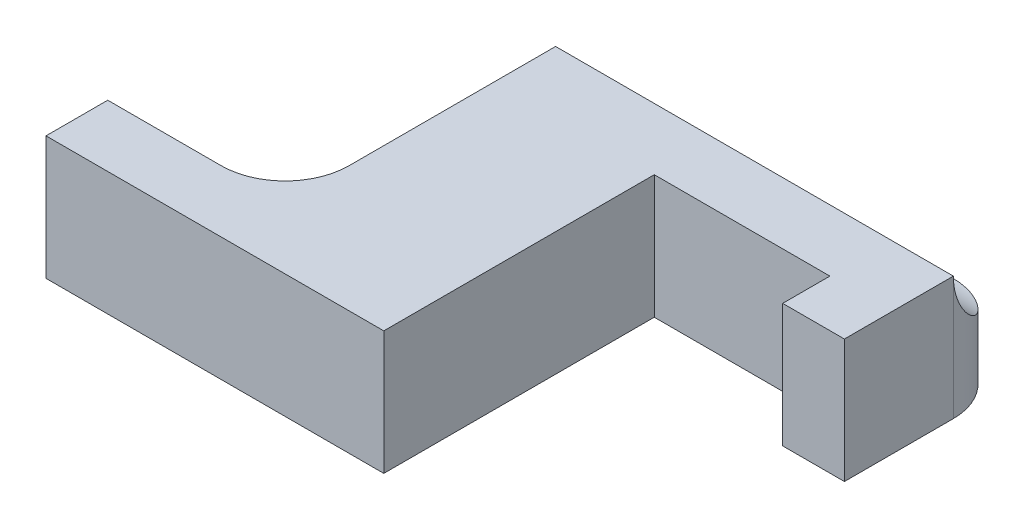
ISO-10303-21;
HEADER;
FILE_DESCRIPTION(('STEP AP214'),'2;1');
FILE_NAME('part.step','',(''),(''),'','','');
FILE_SCHEMA(('AUTOMOTIVE_DESIGN { 1 0 10303 214 1 1 1 1 }'));
ENDSEC;
DATA;
#1=APPLICATION_CONTEXT('core data for automotive mechanical design processes');
#2=APPLICATION_PROTOCOL_DEFINITION('international standard','automotive_design',2000,#1);
#3=PRODUCT_CONTEXT('',#1,'mechanical');
#4=PRODUCT('Part','Part','',(#3));
#5=PRODUCT_RELATED_PRODUCT_CATEGORY('part','',(#4));
#6=PRODUCT_DEFINITION_FORMATION('','',#4);
#7=PRODUCT_DEFINITION_CONTEXT('part definition',#1,'design');
#8=PRODUCT_DEFINITION('design','',#6,#7);
#9=PRODUCT_DEFINITION_SHAPE('','',#8);
#10=(LENGTH_UNIT() NAMED_UNIT(*) SI_UNIT(.MILLI.,.METRE.));
#11=(NAMED_UNIT(*) PLANE_ANGLE_UNIT() SI_UNIT($,.RADIAN.));
#12=(NAMED_UNIT(*) SI_UNIT($,.STERADIAN.) SOLID_ANGLE_UNIT());
#13=UNCERTAINTY_MEASURE_WITH_UNIT(LENGTH_MEASURE(1.E-05),#10,'distance_accuracy_value','');
#14=(GEOMETRIC_REPRESENTATION_CONTEXT(3) GLOBAL_UNCERTAINTY_ASSIGNED_CONTEXT((#13)) GLOBAL_UNIT_ASSIGNED_CONTEXT((#10,
#11,#12)) REPRESENTATION_CONTEXT('',''));
#15=CARTESIAN_POINT('',(0.,0.,0.));
#16=DIRECTION('',(0.,0.,1.));
#17=DIRECTION('',(1.,0.,0.));
#18=AXIS2_PLACEMENT_3D('',#15,#16,#17);
#19=CARTESIAN_POINT('',(-43.7469614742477,-10.16,-15.2607322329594));
#20=DIRECTION('',(0.,-1.,0.));
#21=DIRECTION('',(0.,0.,-1.));
#22=AXIS2_PLACEMENT_3D('',#19,#20,#21);
#23=PLANE('',#22);
#24=DIRECTION('',(0.,0.,-1.));
#25=VECTOR('',#24,1.);
#26=CARTESIAN_POINT('',(22.4271600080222,-10.16,-4.92293223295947));
#27=LINE('',#26,#25);
#28=CARTESIAN_POINT('',(22.4271600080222,-10.16,-4.92293223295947));
#29=VERTEX_POINT('',#28);
#30=CARTESIAN_POINT('',(22.4271600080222,-10.16,-10.0029322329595));
#31=VERTEX_POINT('',#30);
#32=EDGE_CURVE('E42',#29,#31,#27,.T.);
#33=ORIENTED_EDGE('',*,*,#32,.T.);
#34=DIRECTION('',(1.,0.,0.));
#35=VECTOR('',#34,1.);
#36=CARTESIAN_POINT('',(22.4271600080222,-10.16,-10.0029322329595));
#37=LINE('',#36,#35);
#38=CARTESIAN_POINT('',(31.7672385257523,-10.16,-10.0029322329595));
#39=VERTEX_POINT('',#38);
#40=EDGE_CURVE('E161',#31,#39,#37,.T.);
#41=ORIENTED_EDGE('',*,*,#40,.T.);
#42=CARTESIAN_POINT('',(31.7672385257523,-10.16,-15.2607322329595));
#43=DIRECTION('',(0.,1.,0.));
#44=DIRECTION('',(1.,0.,0.));
#45=AXIS2_PLACEMENT_3D('',#42,#43,#44);
#46=CIRCLE('',#45,5.2578);
#47=CARTESIAN_POINT('',(37.0250385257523,-10.16,-15.2607322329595));
#48=VERTEX_POINT('',#47);
#49=EDGE_CURVE('E137',#39,#48,#46,.T.);
#50=ORIENTED_EDGE('',*,*,#49,.T.);
#51=DIRECTION('',(0.,0.,-1.));
#52=VECTOR('',#51,1.);
#53=CARTESIAN_POINT('',(37.0250385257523,-10.16,-15.2607322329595));
#54=LINE('',#53,#52);
#55=CARTESIAN_POINT('',(37.0250385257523,-10.16,-32.2620041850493));
#56=VERTEX_POINT('',#55);
#57=EDGE_CURVE('E134',#48,#56,#54,.T.);
#58=ORIENTED_EDGE('',*,*,#57,.T.);
#59=CARTESIAN_POINT('',(41.9272385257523,-10.16,-32.2620041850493));
#60=DIRECTION('',(0.,1.,0.));
#61=DIRECTION('',(1.,0.,0.));
#62=AXIS2_PLACEMENT_3D('',#59,#60,#61);
#63=CIRCLE('',#62,4.90220000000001);
#64=CARTESIAN_POINT('',(41.9272385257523,-10.16,-37.1642041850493));
#65=VERTEX_POINT('',#64);
#66=EDGE_CURVE('E200',#56,#65,#63,.F.);
#67=ORIENTED_EDGE('',*,*,#66,.T.);
#68=DIRECTION('',(1.,0.,0.));
#69=VECTOR('',#68,1.);
#70=CARTESIAN_POINT('',(41.9272385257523,-10.16,-37.1642041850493));
#71=LINE('',#70,#69);
#72=CARTESIAN_POINT('',(64.8557385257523,-10.16,-37.1642041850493));
#73=VERTEX_POINT('',#72);
#74=EDGE_CURVE('E196',#65,#73,#71,.T.);
#75=ORIENTED_EDGE('',*,*,#74,.T.);
#76=CARTESIAN_POINT('',(64.8557385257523,-10.16,-32.2620041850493));
#77=DIRECTION('',(0.,1.,0.));
#78=DIRECTION('',(1.,0.,0.));
#79=AXIS2_PLACEMENT_3D('',#76,#77,#78);
#80=CIRCLE('',#79,4.90220000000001);
#81=CARTESIAN_POINT('',(69.7579385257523,-10.16,-32.2620041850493));
#82=VERTEX_POINT('',#81);
#83=EDGE_CURVE('E192',#73,#82,#80,.F.);
#84=ORIENTED_EDGE('',*,*,#83,.T.);
#85=DIRECTION('',(0.,0.,1.));
#86=VECTOR('',#85,1.);
#87=CARTESIAN_POINT('',(69.7579385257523,-10.16,-32.2620041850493));
#88=LINE('',#87,#86);
#89=CARTESIAN_POINT('',(69.7579385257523,-10.16,-23.2958041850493));
#90=VERTEX_POINT('',#89);
#91=EDGE_CURVE('E188',#82,#90,#88,.T.);
#92=ORIENTED_EDGE('',*,*,#91,.T.);
#93=DIRECTION('',(-1.,0.,0.));
#94=VECTOR('',#93,1.);
#95=CARTESIAN_POINT('',(69.7579385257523,-10.16,-23.2958041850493));
#96=LINE('',#95,#94);
#97=CARTESIAN_POINT('',(64.6779385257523,-10.16,-23.2958041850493));
#98=VERTEX_POINT('',#97);
#99=EDGE_CURVE('E184',#90,#98,#96,.T.);
#100=ORIENTED_EDGE('',*,*,#99,.T.);
#101=DIRECTION('',(0.,0.,-1.));
#102=VECTOR('',#101,1.);
#103=CARTESIAN_POINT('',(64.6779385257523,-10.16,-23.2958041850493));
#104=LINE('',#103,#102);
#105=CARTESIAN_POINT('',(64.6779385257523,-10.16,-27.1820041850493));
#106=VERTEX_POINT('',#105);
#107=EDGE_CURVE('E180',#98,#106,#104,.T.);
#108=ORIENTED_EDGE('',*,*,#107,.T.);
#109=DIRECTION('',(-1.,0.,0.));
#110=VECTOR('',#109,1.);
#111=CARTESIAN_POINT('',(64.6779385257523,-10.16,-27.1820041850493));
#112=LINE('',#111,#110);
#113=CARTESIAN_POINT('',(50.2253385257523,-10.16,-27.1820041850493));
#114=VERTEX_POINT('',#113);
#115=EDGE_CURVE('E176',#106,#114,#112,.T.);
#116=ORIENTED_EDGE('',*,*,#115,.T.);
#117=DIRECTION('',(0.,0.,1.));
#118=VECTOR('',#117,1.);
#119=CARTESIAN_POINT('',(50.2253385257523,-10.16,-27.1820041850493));
#120=LINE('',#119,#118);
#121=CARTESIAN_POINT('',(50.2253385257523,-10.16,-4.92293223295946));
#122=VERTEX_POINT('',#121);
#123=EDGE_CURVE('E172',#114,#122,#120,.T.);
#124=ORIENTED_EDGE('',*,*,#123,.T.);
#125=DIRECTION('',(-1.,0.,0.));
#126=VECTOR('',#125,1.);
#127=CARTESIAN_POINT('',(50.2253385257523,-10.16,-4.92293223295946));
#128=LINE('',#127,#126);
#129=EDGE_CURVE('E168',#122,#29,#128,.T.);
#130=ORIENTED_EDGE('',*,*,#129,.T.);
#131=EDGE_LOOP('',(#33,#41,#50,#58,#67,#75,#84,#92,#100,#108,#116,#124,#130));
#132=FACE_BOUND('',#131,.T.);
#133=ADVANCED_FACE('F35',(#132),#23,.T.);
#134=CARTESIAN_POINT('',(31.7672385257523,0.,-15.2607322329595));
#135=DIRECTION('',(0.,-1.,0.));
#136=DIRECTION('',(0.,0.,1.));
#137=AXIS2_PLACEMENT_3D('',#134,#135,#136);
#138=PLANE('',#137);
#139=DIRECTION('',(0.,0.,-1.));
#140=VECTOR('',#139,1.);
#141=CARTESIAN_POINT('',(37.0250385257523,0.,-15.2607322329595));
#142=LINE('',#141,#140);
#143=CARTESIAN_POINT('',(37.0250385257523,0.,-15.2607322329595));
#144=VERTEX_POINT('',#143);
#145=CARTESIAN_POINT('',(37.0250385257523,0.,-32.2620041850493));
#146=VERTEX_POINT('',#145);
#147=EDGE_CURVE('E132',#144,#146,#142,.T.);
#148=ORIENTED_EDGE('',*,*,#147,.F.);
#149=CARTESIAN_POINT('',(31.7672385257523,0.,-15.2607322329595));
#150=DIRECTION('',(0.,1.,0.));
#151=DIRECTION('',(0.,0.,1.));
#152=AXIS2_PLACEMENT_3D('',#149,#150,#151);
#153=CIRCLE('',#152,5.2578);
#154=CARTESIAN_POINT('',(31.7672385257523,0.,-10.0029322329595));
#155=VERTEX_POINT('',#154);
#156=EDGE_CURVE('E140',#155,#144,#153,.T.);
#157=ORIENTED_EDGE('',*,*,#156,.F.);
#158=DIRECTION('',(1.,0.,0.));
#159=VECTOR('',#158,1.);
#160=CARTESIAN_POINT('',(22.4271600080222,0.,-10.0029322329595));
#161=LINE('',#160,#159);
#162=CARTESIAN_POINT('',(22.4271600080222,0.,-10.0029322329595));
#163=VERTEX_POINT('',#162);
#164=EDGE_CURVE('E144',#163,#155,#161,.T.);
#165=ORIENTED_EDGE('',*,*,#164,.F.);
#166=DIRECTION('',(0.,0.,-1.));
#167=VECTOR('',#166,1.);
#168=CARTESIAN_POINT('',(22.4271600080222,0.,-4.92293223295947));
#169=LINE('',#168,#167);
#170=CARTESIAN_POINT('',(22.4271600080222,0.,-4.92293223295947));
#171=VERTEX_POINT('',#170);
#172=EDGE_CURVE('E158',#171,#163,#169,.T.);
#173=ORIENTED_EDGE('',*,*,#172,.F.);
#174=DIRECTION('',(-1.,0.,0.));
#175=VECTOR('',#174,1.);
#176=CARTESIAN_POINT('',(50.2253385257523,0.,-4.92293223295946));
#177=LINE('',#176,#175);
#178=CARTESIAN_POINT('',(50.2253385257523,0.,-4.92293223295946));
#179=VERTEX_POINT('',#178);
#180=EDGE_CURVE('E164',#179,#171,#177,.T.);
#181=ORIENTED_EDGE('',*,*,#180,.F.);
#182=DIRECTION('',(0.,0.,1.));
#183=VECTOR('',#182,1.);
#184=CARTESIAN_POINT('',(50.2253385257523,0.,-27.1820041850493));
#185=LINE('',#184,#183);
#186=CARTESIAN_POINT('',(50.2253385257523,0.,-27.1820041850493));
#187=VERTEX_POINT('',#186);
#188=EDGE_CURVE('E249',#187,#179,#185,.T.);
#189=ORIENTED_EDGE('',*,*,#188,.F.);
#190=DIRECTION('',(-1.,0.,0.));
#191=VECTOR('',#190,1.);
#192=CARTESIAN_POINT('',(64.6779385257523,0.,-27.1820041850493));
#193=LINE('',#192,#191);
#194=CARTESIAN_POINT('',(64.6779385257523,0.,-27.1820041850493));
#195=VERTEX_POINT('',#194);
#196=EDGE_CURVE('E244',#195,#187,#193,.T.);
#197=ORIENTED_EDGE('',*,*,#196,.F.);
#198=DIRECTION('',(0.,0.,-1.));
#199=VECTOR('',#198,1.);
#200=CARTESIAN_POINT('',(64.6779385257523,0.,-23.2958041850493));
#201=LINE('',#200,#199);
#202=CARTESIAN_POINT('',(64.6779385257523,0.,-23.2958041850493));
#203=VERTEX_POINT('',#202);
#204=EDGE_CURVE('E242',#203,#195,#201,.T.);
#205=ORIENTED_EDGE('',*,*,#204,.F.);
#206=DIRECTION('',(-1.,0.,0.));
#207=VECTOR('',#206,1.);
#208=CARTESIAN_POINT('',(69.7579385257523,0.,-23.2958041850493));
#209=LINE('',#208,#207);
#210=CARTESIAN_POINT('',(69.7579385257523,0.,-23.2958041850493));
#211=VERTEX_POINT('',#210);
#212=EDGE_CURVE('E153',#211,#203,#209,.T.);
#213=ORIENTED_EDGE('',*,*,#212,.F.);
#214=DIRECTION('',(0.,0.,1.));
#215=VECTOR('',#214,1.);
#216=CARTESIAN_POINT('',(69.7579385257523,0.,-32.2620041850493));
#217=LINE('',#216,#215);
#218=CARTESIAN_POINT('',(69.7579385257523,0.,-32.2620041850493));
#219=VERTEX_POINT('',#218);
#220=EDGE_CURVE('E150',#219,#211,#217,.T.);
#221=ORIENTED_EDGE('',*,*,#220,.F.);
#222=DIRECTION('',(1.,0.,0.));
#223=VECTOR('',#222,1.);
#224=CARTESIAN_POINT('',(22.4271600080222,0.,-32.2620041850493));
#225=LINE('',#224,#223);
#226=EDGE_CURVE('E149',#146,#219,#225,.T.);
#227=ORIENTED_EDGE('',*,*,#226,.F.);
#228=EDGE_LOOP('',(#148,#157,#165,#173,#181,#189,#197,#205,#213,#221,#227));
#229=FACE_BOUND('',#228,.T.);
#230=ADVANCED_FACE('F147',(#229),#138,.F.);
#231=CARTESIAN_POINT('',(22.4271600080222,-67.428684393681,-10.0029322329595));
#232=DIRECTION('',(0.,0.,-1.));
#233=DIRECTION('',(1.,0.,0.));
#234=AXIS2_PLACEMENT_3D('',#231,#232,#233);
#235=PLANE('',#234);
#236=DIRECTION('',(0.,1.,0.));
#237=VECTOR('',#236,1.);
#238=CARTESIAN_POINT('',(22.4271600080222,-67.428684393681,-10.0029322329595));
#239=LINE('',#238,#237);
#240=EDGE_CURVE('E11',#31,#163,#239,.T.);
#241=ORIENTED_EDGE('',*,*,#240,.T.);
#242=ORIENTED_EDGE('',*,*,#164,.T.);
#243=DIRECTION('',(0.,1.,0.));
#244=VECTOR('',#243,1.);
#245=CARTESIAN_POINT('',(31.7672385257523,-67.428684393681,-10.0029322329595));
#246=LINE('',#245,#244);
#247=EDGE_CURVE('E106',#39,#155,#246,.T.);
#248=ORIENTED_EDGE('',*,*,#247,.F.);
#249=ORIENTED_EDGE('',*,*,#40,.F.);
#250=EDGE_LOOP('',(#241,#242,#248,#249));
#251=FACE_BOUND('',#250,.T.);
#252=ADVANCED_FACE('F274',(#251),#235,.T.);
#253=CARTESIAN_POINT('',(31.7672385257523,-67.428684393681,-15.2607322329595));
#254=DIRECTION('',(0.,1.,0.));
#255=DIRECTION('',(0.,0.,-1.));
#256=AXIS2_PLACEMENT_3D('',#253,#254,#255);
#257=CYLINDRICAL_SURFACE('',#256,5.2578);
#258=ORIENTED_EDGE('',*,*,#247,.T.);
#259=ORIENTED_EDGE('',*,*,#156,.T.);
#260=DIRECTION('',(0.,1.,0.));
#261=VECTOR('',#260,1.);
#262=CARTESIAN_POINT('',(37.0250385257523,-67.428684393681,-15.2607322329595));
#263=LINE('',#262,#261);
#264=EDGE_CURVE('E128',#48,#144,#263,.T.);
#265=ORIENTED_EDGE('',*,*,#264,.F.);
#266=ORIENTED_EDGE('',*,*,#49,.F.);
#267=EDGE_LOOP('',(#258,#259,#265,#266));
#268=FACE_BOUND('',#267,.T.);
#269=ADVANCED_FACE('F141',(#268),#257,.F.);
#270=CARTESIAN_POINT('',(37.0250385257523,-67.428684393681,-15.2607322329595));
#271=DIRECTION('',(-1.,0.,0.));
#272=DIRECTION('',(0.,0.,-1.));
#273=AXIS2_PLACEMENT_3D('',#270,#271,#272);
#274=PLANE('',#273);
#275=ORIENTED_EDGE('',*,*,#264,.T.);
#276=ORIENTED_EDGE('',*,*,#147,.T.);
#277=DIRECTION('',(0.,1.,0.));
#278=VECTOR('',#277,1.);
#279=CARTESIAN_POINT('',(37.0250385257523,-67.428684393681,-32.2620041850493));
#280=LINE('',#279,#278);
#281=EDGE_CURVE('E203',#56,#146,#280,.T.);
#282=ORIENTED_EDGE('',*,*,#281,.F.);
#283=ORIENTED_EDGE('',*,*,#57,.F.);
#284=EDGE_LOOP('',(#275,#276,#282,#283));
#285=FACE_BOUND('',#284,.T.);
#286=ADVANCED_FACE('F130',(#285),#274,.T.);
#287=CARTESIAN_POINT('',(41.9272385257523,-67.428684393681,-32.2620041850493));
#288=DIRECTION('',(0.,1.,0.));
#289=DIRECTION('',(0.,0.,-1.));
#290=AXIS2_PLACEMENT_3D('',#287,#288,#289);
#291=CYLINDRICAL_SURFACE('',#290,4.90220000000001);
#292=CARTESIAN_POINT('',(37.0250385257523,0.,-32.2620041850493));
#293=CARTESIAN_POINT('',(37.0250837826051,-0.141476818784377,-32.2619894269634));
#294=CARTESIAN_POINT('',(37.0250399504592,-0.282951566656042,-32.2679137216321));
#295=CARTESIAN_POINT('',(37.02510115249,-0.564914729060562,-32.2915342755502));
#296=CARTESIAN_POINT('',(37.0252061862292,-0.705403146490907,-32.3092305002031));
#297=CARTESIAN_POINT('',(37.0258928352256,-0.984686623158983,-32.3563350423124));
#298=CARTESIAN_POINT('',(37.0264753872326,-1.1234778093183,-32.3857663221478));
#299=CARTESIAN_POINT('',(37.0287563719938,-1.39810469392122,-32.456127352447));
#300=CARTESIAN_POINT('',(37.0304547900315,-1.5339404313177,-32.4970569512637));
#301=CARTESIAN_POINT('',(37.0358130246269,-1.80184382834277,-32.5901736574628));
#302=CARTESIAN_POINT('',(37.0394751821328,-1.93390679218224,-32.6423741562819));
#303=CARTESIAN_POINT('',(37.0498109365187,-2.19310130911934,-32.757593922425));
#304=CARTESIAN_POINT('',(37.0564843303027,-2.32023319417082,-32.8206124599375));
#305=CARTESIAN_POINT('',(37.0740501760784,-2.56847018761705,-32.9568713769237));
#306=CARTESIAN_POINT('',(37.0849392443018,-2.68958004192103,-33.0301035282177));
#307=CARTESIAN_POINT('',(37.1122736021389,-2.92484744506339,-33.1860949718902));
#308=CARTESIAN_POINT('',(37.1287184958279,-3.03900548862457,-33.2688535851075));
#309=CARTESIAN_POINT('',(37.1677098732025,-3.25460334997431,-33.4391831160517));
#310=CARTESIAN_POINT('',(37.1899644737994,-3.3563786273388,-33.5263954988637));
#311=CARTESIAN_POINT('',(37.2420582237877,-3.55171532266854,-33.7075230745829));
#312=CARTESIAN_POINT('',(37.2718971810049,-3.64527694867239,-33.8014380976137));
#313=CARTESIAN_POINT('',(37.3402145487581,-3.82324792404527,-33.9944111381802));
#314=CARTESIAN_POINT('',(37.3786811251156,-3.90766957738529,-34.0934619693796));
#315=CARTESIAN_POINT('',(37.4651623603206,-4.06684619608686,-34.2950958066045));
#316=CARTESIAN_POINT('',(37.5131752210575,-4.1416029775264,-34.3976781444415));
#317=CARTESIAN_POINT('',(37.6116568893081,-4.27100568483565,-34.5894947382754));
#318=CARTESIAN_POINT('',(37.6607727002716,-4.3269970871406,-34.6785202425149));
#319=CARTESIAN_POINT('',(37.7665594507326,-4.43158434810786,-34.8564249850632));
#320=CARTESIAN_POINT('',(37.8232299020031,-4.4801806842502,-34.9453042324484));
#321=CARTESIAN_POINT('',(37.9440732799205,-4.57012883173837,-35.1216165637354));
#322=CARTESIAN_POINT('',(38.0082465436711,-4.61148031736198,-35.2090495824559));
#323=CARTESIAN_POINT('',(38.1438538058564,-4.68728243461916,-35.3812305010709));
#324=CARTESIAN_POINT('',(38.2152878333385,-4.72173303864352,-35.4659783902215));
#325=CARTESIAN_POINT('',(38.3603354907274,-4.7822888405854,-35.6264845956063));
#326=CARTESIAN_POINT('',(38.433533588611,-4.80878115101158,-35.7024736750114));
#327=CARTESIAN_POINT('',(38.5855765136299,-4.85668218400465,-35.8503338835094));
#328=CARTESIAN_POINT('',(38.6644231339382,-4.87808928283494,-35.922203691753));
#329=CARTESIAN_POINT('',(38.8272708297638,-4.91639149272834,-36.0611109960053));
#330=CARTESIAN_POINT('',(38.9112709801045,-4.9332874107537,-36.1281493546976));
#331=CARTESIAN_POINT('',(39.0839557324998,-4.96318848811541,-36.2568668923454));
#332=CARTESIAN_POINT('',(39.1726420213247,-4.97619223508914,-36.3185441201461));
#333=CARTESIAN_POINT('',(39.4618779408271,-5.01240745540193,-36.5057422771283));
#334=CARTESIAN_POINT('',(39.6704519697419,-5.02945528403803,-36.6203108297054));
#335=CARTESIAN_POINT('',(40.1025231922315,-5.05390878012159,-36.8181578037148));
#336=CARTESIAN_POINT('',(40.3260294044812,-5.06130856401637,-36.9014171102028));
#337=CARTESIAN_POINT('',(40.6656494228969,-5.06860877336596,-37.0005117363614));
#338=CARTESIAN_POINT('',(40.7781605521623,-5.07040906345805,-37.0290426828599));
#339=CARTESIAN_POINT('',(41.004952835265,-5.07319881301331,-37.0780607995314));
#340=CARTESIAN_POINT('',(41.1192339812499,-5.07418827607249,-37.098548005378));
#341=CARTESIAN_POINT('',(41.3488439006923,-5.07565789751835,-37.1313429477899));
#342=CARTESIAN_POINT('',(41.4641715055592,-5.07613856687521,-37.1436588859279));
#343=CARTESIAN_POINT('',(41.6954112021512,-5.07674304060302,-37.1600928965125));
#344=CARTESIAN_POINT('',(41.8113232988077,-5.07686684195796,-37.1642108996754));
#345=CARTESIAN_POINT('',(41.9272385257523,-5.07688754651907,-37.1642041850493));
#346=B_SPLINE_CURVE_WITH_KNOTS('',3,(#292,#293,#294,#295,#296,#297,#298,#299,#300,#301,#302,
#303,#304,#305,#306,#307,#308,#309,#310,#311,#312,#313,#314,#315,#316,#317,#318,#319,#320,#321,
#322,#323,#324,#325,#326,#327,#328,#329,#330,#331,#332,#333,#334,#335,#336,#337,#338,#339,#340,
#341,#342,#343,#344,#345),.UNSPECIFIED.,.F.,.F.,(4,2,2,2,2,2,2,2,2,2,2,2,2,2,2,2,2,2,2,2,2,2,2,
2,2,2,4),(0.,0.424303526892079,0.848605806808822,1.27374244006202,1.69887346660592,
2.12451241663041,2.55012266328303,2.97539199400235,3.4006310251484,3.80763525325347,
4.21462916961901,4.62106820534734,5.02743075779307,5.37518369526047,5.72291416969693,
6.07066027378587,6.41840776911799,6.74441266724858,7.0705215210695,7.39657200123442,
7.72274065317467,8.43541304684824,9.14851983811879,9.49653487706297,9.84454837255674,
10.1922120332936,10.5398786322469),.UNSPECIFIED.);
#347=CARTESIAN_POINT('',(41.9272385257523,-5.07688754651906,-37.1642041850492));
#348=VERTEX_POINT('',#347);
#349=EDGE_CURVE('E160',#146,#348,#346,.T.);
#350=ORIENTED_EDGE('',*,*,#349,.T.);
#351=DIRECTION('',(0.,1.,0.));
#352=VECTOR('',#351,1.);
#353=CARTESIAN_POINT('',(41.9272385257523,-67.428684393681,-37.1642041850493));
#354=LINE('',#353,#352);
#355=EDGE_CURVE('E199',#65,#348,#354,.T.);
#356=ORIENTED_EDGE('',*,*,#355,.F.);
#357=ORIENTED_EDGE('',*,*,#66,.F.);
#358=ORIENTED_EDGE('',*,*,#281,.T.);
#359=EDGE_LOOP('',(#350,#356,#357,#358));
#360=FACE_BOUND('',#359,.T.);
#361=ADVANCED_FACE('F221',(#360),#291,.T.);
#362=CARTESIAN_POINT('',(41.9272385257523,-67.428684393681,-37.1642041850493));
#363=DIRECTION('',(0.,0.,-1.));
#364=DIRECTION('',(1.,0.,0.));
#365=AXIS2_PLACEMENT_3D('',#362,#363,#364);
#366=PLANE('',#365);
#367=DIRECTION('',(1.,0.,0.));
#368=VECTOR('',#367,1.);
#369=CARTESIAN_POINT('',(22.4271600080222,-5.07688754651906,-37.1642041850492));
#370=LINE('',#369,#368);
#371=CARTESIAN_POINT('',(64.8557385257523,-5.07688754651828,-37.1642041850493));
#372=VERTEX_POINT('',#371);
#373=EDGE_CURVE('E226',#348,#372,#370,.T.);
#374=ORIENTED_EDGE('',*,*,#373,.T.);
#375=DIRECTION('',(0.,1.,0.));
#376=VECTOR('',#375,1.);
#377=CARTESIAN_POINT('',(64.8557385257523,-67.428684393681,-37.1642041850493));
#378=LINE('',#377,#376);
#379=EDGE_CURVE('E195',#73,#372,#378,.T.);
#380=ORIENTED_EDGE('',*,*,#379,.F.);
#381=ORIENTED_EDGE('',*,*,#74,.F.);
#382=ORIENTED_EDGE('',*,*,#355,.T.);
#383=EDGE_LOOP('',(#374,#380,#381,#382));
#384=FACE_BOUND('',#383,.T.);
#385=ADVANCED_FACE('F270',(#384),#366,.T.);
#386=CARTESIAN_POINT('',(64.8557385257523,-67.428684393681,-32.2620041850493));
#387=DIRECTION('',(0.,1.,0.));
#388=DIRECTION('',(0.,0.,-1.));
#389=AXIS2_PLACEMENT_3D('',#386,#387,#388);
#390=CYLINDRICAL_SURFACE('',#389,4.90220000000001);
#391=CARTESIAN_POINT('',(64.8557385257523,-5.07688754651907,-37.1642041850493));
#392=CARTESIAN_POINT('',(64.991731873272,-5.07684785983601,-37.1642183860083));
#393=CARTESIAN_POINT('',(65.1277240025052,-5.0766880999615,-37.1585458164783));
#394=CARTESIAN_POINT('',(65.3987686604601,-5.07584180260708,-37.1359287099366));
#395=CARTESIAN_POINT('',(65.5338211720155,-5.07515525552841,-37.1189839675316));
#396=CARTESIAN_POINT('',(65.8022954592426,-5.07296668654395,-37.0738819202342));
#397=CARTESIAN_POINT('',(65.9357137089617,-5.07146314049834,-37.0457036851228));
#398=CARTESIAN_POINT('',(66.1997184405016,-5.06707959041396,-36.9783415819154));
#399=CARTESIAN_POINT('',(66.3303049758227,-5.06419961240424,-36.9391579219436));
#400=CARTESIAN_POINT('',(66.5878695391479,-5.05631800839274,-36.8500191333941));
#401=CARTESIAN_POINT('',(66.7148428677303,-5.05131374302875,-36.8000506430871));
#402=CARTESIAN_POINT('',(66.9640525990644,-5.03826126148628,-36.6897733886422));
#403=CARTESIAN_POINT('',(67.0862893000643,-5.03021323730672,-36.6294652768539));
#404=CARTESIAN_POINT('',(67.3249670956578,-5.01001508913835,-36.4990961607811));
#405=CARTESIAN_POINT('',(67.4414130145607,-4.99786844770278,-36.4290434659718));
#406=CARTESIAN_POINT('',(67.6676359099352,-4.96830199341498,-36.279858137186));
#407=CARTESIAN_POINT('',(67.7774133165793,-4.95088252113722,-36.200726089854));
#408=CARTESIAN_POINT('',(67.9850891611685,-4.91037836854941,-36.037644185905));
#409=CARTESIAN_POINT('',(68.0832869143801,-4.88754771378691,-35.9540129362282));
#410=CARTESIAN_POINT('',(68.2718019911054,-4.83484778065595,-35.7803131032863));
#411=CARTESIAN_POINT('',(68.3621195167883,-4.8049786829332,-35.6902446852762));
#412=CARTESIAN_POINT('',(68.534029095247,-4.73728725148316,-35.5051019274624));
#413=CARTESIAN_POINT('',(68.6156306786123,-4.69947374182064,-35.4100332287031));
#414=CARTESIAN_POINT('',(68.7696260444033,-4.61511346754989,-35.216381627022));
#415=CARTESIAN_POINT('',(68.8420212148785,-4.56856802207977,-35.1177992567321));
#416=CARTESIAN_POINT('',(68.9686919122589,-4.47274222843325,-34.9315021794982));
#417=CARTESIAN_POINT('',(69.0241010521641,-4.42455519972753,-34.8439927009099));
#418=CARTESIAN_POINT('',(69.1276028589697,-4.32101629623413,-34.6688862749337));
#419=CARTESIAN_POINT('',(69.1756958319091,-4.26566472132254,-34.5812893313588));
#420=CARTESIAN_POINT('',(69.2647135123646,-4.14784739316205,-34.4072459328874));
#421=CARTESIAN_POINT('',(69.3056379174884,-4.08538133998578,-34.3207995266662));
#422=CARTESIAN_POINT('',(69.3806518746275,-3.95355669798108,-34.1502324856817));
#423=CARTESIAN_POINT('',(69.4147413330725,-3.88419801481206,-34.0661118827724));
#424=CARTESIAN_POINT('',(69.4751843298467,-3.74222448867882,-33.904975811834));
#425=CARTESIAN_POINT('',(69.501817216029,-3.66989715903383,-33.8278109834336));
#426=CARTESIAN_POINT('',(69.5498428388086,-3.51965621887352,-33.6773449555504));
#427=CARTESIAN_POINT('',(69.5712338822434,-3.44174081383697,-33.6040450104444));
#428=CARTESIAN_POINT('',(69.609361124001,-3.28080160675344,-33.4620224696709));
#429=CARTESIAN_POINT('',(69.6260980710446,-3.19777862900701,-33.393299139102));
#430=CARTESIAN_POINT('',(69.6555591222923,-3.02705170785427,-33.2609466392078));
#431=CARTESIAN_POINT('',(69.6682817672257,-2.9393460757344,-33.197319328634));
#432=CARTESIAN_POINT('',(69.6915283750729,-2.75010174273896,-33.0690932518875));
#433=CARTESIAN_POINT('',(69.7016694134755,-2.64808906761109,-33.0051241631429));
#434=CARTESIAN_POINT('',(69.7186405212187,-2.43953035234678,-32.8844695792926));
#435=CARTESIAN_POINT('',(69.7254691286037,-2.33298233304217,-32.8277873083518));
#436=CARTESIAN_POINT('',(69.736591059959,-2.11595894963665,-32.722080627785));
#437=CARTESIAN_POINT('',(69.7408830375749,-2.00548153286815,-32.6730602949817));
#438=CARTESIAN_POINT('',(69.7476260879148,-1.78126322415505,-32.5830021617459));
#439=CARTESIAN_POINT('',(69.7500770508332,-1.66752213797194,-32.5419648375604));
#440=CARTESIAN_POINT('',(69.7539058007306,-1.42725005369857,-32.4648488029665));
#441=CARTESIAN_POINT('',(69.7551701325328,-1.30047452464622,-32.4295245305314));
#442=CARTESIAN_POINT('',(69.7568682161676,-1.0445527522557,-32.3688150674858));
#443=CARTESIAN_POINT('',(69.7573018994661,-0.915406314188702,-32.3434306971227));
#444=CARTESIAN_POINT('',(69.7578136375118,-0.65560734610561,-32.3027733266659));
#445=CARTESIAN_POINT('',(69.7578918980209,-0.524955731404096,-32.2874944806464));
#446=CARTESIAN_POINT('',(69.7579374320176,-0.262869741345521,-32.2671046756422));
#447=CARTESIAN_POINT('',(69.7579047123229,-0.131435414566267,-32.2619930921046));
#448=CARTESIAN_POINT('',(69.7579385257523,0.,-32.2620041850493));
#449=B_SPLINE_CURVE_WITH_KNOTS('',3,(#391,#392,#393,#394,#395,#396,#397,#398,#399,#400,#401,
#402,#403,#404,#405,#406,#407,#408,#409,#410,#411,#412,#413,#414,#415,#416,#417,#418,#419,#420,
#421,#422,#423,#424,#425,#426,#427,#428,#429,#430,#431,#432,#433,#434,#435,#436,#437,#438,#439,
#440,#441,#442,#443,#444,#445,#446,#447,#448),.UNSPECIFIED.,.F.,.F.,(4,2,2,2,2,2,2,2,2,2,2,2,2,
2,2,2,2,2,2,2,2,2,2,2,2,2,2,2,4),(0.,0.40786010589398,0.815727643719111,1.22435869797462,
1.63298202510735,2.04211454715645,2.45122126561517,2.85998124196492,3.26871482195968,
3.66112534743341,4.05352580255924,4.4454926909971,4.83740041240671,5.17966371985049,
5.52191270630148,5.8641761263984,6.20644423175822,6.53329100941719,6.86024322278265,
7.18714280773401,7.51416108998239,7.87630335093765,8.23860529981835,8.60109937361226,
8.963615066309,9.35804067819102,9.75249883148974,10.1467285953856,10.5409341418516),.UNSPECIFIED.);
#450=EDGE_CURVE('E49',#372,#219,#449,.T.);
#451=ORIENTED_EDGE('',*,*,#450,.T.);
#452=DIRECTION('',(0.,1.,0.));
#453=VECTOR('',#452,1.);
#454=CARTESIAN_POINT('',(69.7579385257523,-67.428684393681,-32.2620041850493));
#455=LINE('',#454,#453);
#456=EDGE_CURVE('E191',#82,#219,#455,.T.);
#457=ORIENTED_EDGE('',*,*,#456,.F.);
#458=ORIENTED_EDGE('',*,*,#83,.F.);
#459=ORIENTED_EDGE('',*,*,#379,.T.);
#460=EDGE_LOOP('',(#451,#457,#458,#459));
#461=FACE_BOUND('',#460,.T.);
#462=ADVANCED_FACE('F234',(#461),#390,.T.);
#463=CARTESIAN_POINT('',(69.7579385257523,-67.428684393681,-32.2620041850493));
#464=DIRECTION('',(1.,0.,0.));
#465=DIRECTION('',(0.,0.,1.));
#466=AXIS2_PLACEMENT_3D('',#463,#464,#465);
#467=PLANE('',#466);
#468=ORIENTED_EDGE('',*,*,#456,.T.);
#469=ORIENTED_EDGE('',*,*,#220,.T.);
#470=DIRECTION('',(0.,1.,0.));
#471=VECTOR('',#470,1.);
#472=CARTESIAN_POINT('',(69.7579385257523,-67.428684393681,-23.2958041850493));
#473=LINE('',#472,#471);
#474=EDGE_CURVE('E187',#90,#211,#473,.T.);
#475=ORIENTED_EDGE('',*,*,#474,.F.);
#476=ORIENTED_EDGE('',*,*,#91,.F.);
#477=EDGE_LOOP('',(#468,#469,#475,#476));
#478=FACE_BOUND('',#477,.T.);
#479=ADVANCED_FACE('F230',(#478),#467,.T.);
#480=CARTESIAN_POINT('',(69.7579385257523,-67.428684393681,-23.2958041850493));
#481=DIRECTION('',(0.,0.,1.));
#482=DIRECTION('',(-1.,0.,0.));
#483=AXIS2_PLACEMENT_3D('',#480,#481,#482);
#484=PLANE('',#483);
#485=ORIENTED_EDGE('',*,*,#474,.T.);
#486=ORIENTED_EDGE('',*,*,#212,.T.);
#487=DIRECTION('',(0.,1.,0.));
#488=VECTOR('',#487,1.);
#489=CARTESIAN_POINT('',(64.6779385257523,-67.428684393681,-23.2958041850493));
#490=LINE('',#489,#488);
#491=EDGE_CURVE('E183',#98,#203,#490,.T.);
#492=ORIENTED_EDGE('',*,*,#491,.F.);
#493=ORIENTED_EDGE('',*,*,#99,.F.);
#494=EDGE_LOOP('',(#485,#486,#492,#493));
#495=FACE_BOUND('',#494,.T.);
#496=ADVANCED_FACE('F300',(#495),#484,.T.);
#497=CARTESIAN_POINT('',(64.6779385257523,-67.428684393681,-23.2958041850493));
#498=DIRECTION('',(-1.,0.,0.));
#499=DIRECTION('',(0.,0.,-1.));
#500=AXIS2_PLACEMENT_3D('',#497,#498,#499);
#501=PLANE('',#500);
#502=ORIENTED_EDGE('',*,*,#491,.T.);
#503=ORIENTED_EDGE('',*,*,#204,.T.);
#504=DIRECTION('',(0.,1.,0.));
#505=VECTOR('',#504,1.);
#506=CARTESIAN_POINT('',(64.6779385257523,-67.428684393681,-27.1820041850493));
#507=LINE('',#506,#505);
#508=EDGE_CURVE('E179',#106,#195,#507,.T.);
#509=ORIENTED_EDGE('',*,*,#508,.F.);
#510=ORIENTED_EDGE('',*,*,#107,.F.);
#511=EDGE_LOOP('',(#502,#503,#509,#510));
#512=FACE_BOUND('',#511,.T.);
#513=ADVANCED_FACE('F298',(#512),#501,.T.);
#514=CARTESIAN_POINT('',(64.6779385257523,-67.428684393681,-27.1820041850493));
#515=DIRECTION('',(0.,0.,1.));
#516=DIRECTION('',(-1.,0.,0.));
#517=AXIS2_PLACEMENT_3D('',#514,#515,#516);
#518=PLANE('',#517);
#519=ORIENTED_EDGE('',*,*,#508,.T.);
#520=ORIENTED_EDGE('',*,*,#196,.T.);
#521=DIRECTION('',(0.,1.,0.));
#522=VECTOR('',#521,1.);
#523=CARTESIAN_POINT('',(50.2253385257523,-67.428684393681,-27.1820041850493));
#524=LINE('',#523,#522);
#525=EDGE_CURVE('E175',#114,#187,#524,.T.);
#526=ORIENTED_EDGE('',*,*,#525,.F.);
#527=ORIENTED_EDGE('',*,*,#115,.F.);
#528=EDGE_LOOP('',(#519,#520,#526,#527));
#529=FACE_BOUND('',#528,.T.);
#530=ADVANCED_FACE('F295',(#529),#518,.T.);
#531=CARTESIAN_POINT('',(50.2253385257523,-67.428684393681,-27.1820041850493));
#532=DIRECTION('',(1.,0.,0.));
#533=DIRECTION('',(0.,0.,1.));
#534=AXIS2_PLACEMENT_3D('',#531,#532,#533);
#535=PLANE('',#534);
#536=ORIENTED_EDGE('',*,*,#525,.T.);
#537=ORIENTED_EDGE('',*,*,#188,.T.);
#538=DIRECTION('',(0.,1.,0.));
#539=VECTOR('',#538,1.);
#540=CARTESIAN_POINT('',(50.2253385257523,-67.428684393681,-4.92293223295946));
#541=LINE('',#540,#539);
#542=EDGE_CURVE('E171',#122,#179,#541,.T.);
#543=ORIENTED_EDGE('',*,*,#542,.F.);
#544=ORIENTED_EDGE('',*,*,#123,.F.);
#545=EDGE_LOOP('',(#536,#537,#543,#544));
#546=FACE_BOUND('',#545,.T.);
#547=ADVANCED_FACE('F291',(#546),#535,.T.);
#548=CARTESIAN_POINT('',(50.2253385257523,-67.428684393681,-4.92293223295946));
#549=DIRECTION('',(0.,0.,1.));
#550=DIRECTION('',(-1.,0.,0.));
#551=AXIS2_PLACEMENT_3D('',#548,#549,#550);
#552=PLANE('',#551);
#553=ORIENTED_EDGE('',*,*,#542,.T.);
#554=ORIENTED_EDGE('',*,*,#180,.T.);
#555=DIRECTION('',(0.,1.,0.));
#556=VECTOR('',#555,1.);
#557=CARTESIAN_POINT('',(22.4271600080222,-67.428684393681,-4.92293223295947));
#558=LINE('',#557,#556);
#559=EDGE_CURVE('E167',#29,#171,#558,.T.);
#560=ORIENTED_EDGE('',*,*,#559,.F.);
#561=ORIENTED_EDGE('',*,*,#129,.F.);
#562=EDGE_LOOP('',(#553,#554,#560,#561));
#563=FACE_BOUND('',#562,.T.);
#564=ADVANCED_FACE('F288',(#563),#552,.T.);
#565=CARTESIAN_POINT('',(22.4271600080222,-67.428684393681,-4.92293223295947));
#566=DIRECTION('',(-1.,0.,0.));
#567=DIRECTION('',(0.,0.,-1.));
#568=AXIS2_PLACEMENT_3D('',#565,#566,#567);
#569=PLANE('',#568);
#570=ORIENTED_EDGE('',*,*,#559,.T.);
#571=ORIENTED_EDGE('',*,*,#172,.T.);
#572=ORIENTED_EDGE('',*,*,#240,.F.);
#573=ORIENTED_EDGE('',*,*,#32,.F.);
#574=EDGE_LOOP('',(#570,#571,#572,#573));
#575=FACE_BOUND('',#574,.T.);
#576=ADVANCED_FACE('F284',(#575),#569,.T.);
#577=CARTESIAN_POINT('',(22.4271600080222,0.,-37.3420041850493));
#578=DIRECTION('',(1.,0.,0.));
#579=DIRECTION('',(0.,0.,1.));
#580=AXIS2_PLACEMENT_3D('',#577,#578,#579);
#581=CYLINDRICAL_SURFACE('',#580,5.08);
#582=ORIENTED_EDGE('',*,*,#349,.F.);
#583=ORIENTED_EDGE('',*,*,#226,.T.);
#584=ORIENTED_EDGE('',*,*,#450,.F.);
#585=ORIENTED_EDGE('',*,*,#373,.F.);
#586=EDGE_LOOP('',(#582,#583,#584,#585));
#587=FACE_BOUND('',#586,.T.);
#588=ADVANCED_FACE('F236',(#587),#581,.F.);
#589=CLOSED_SHELL('',(#133,#230,#252,#269,#286,#361,#385,#462,#479,#496,#513,#530,#547,#564,
#576,#588));
#590=MANIFOLD_SOLID_BREP('B2',#589);
#591=ADVANCED_BREP_SHAPE_REPRESENTATION('',(#18,#590),#14);
#592=SHAPE_DEFINITION_REPRESENTATION(#9,#591);
ENDSEC;
END-ISO-10303-21;
